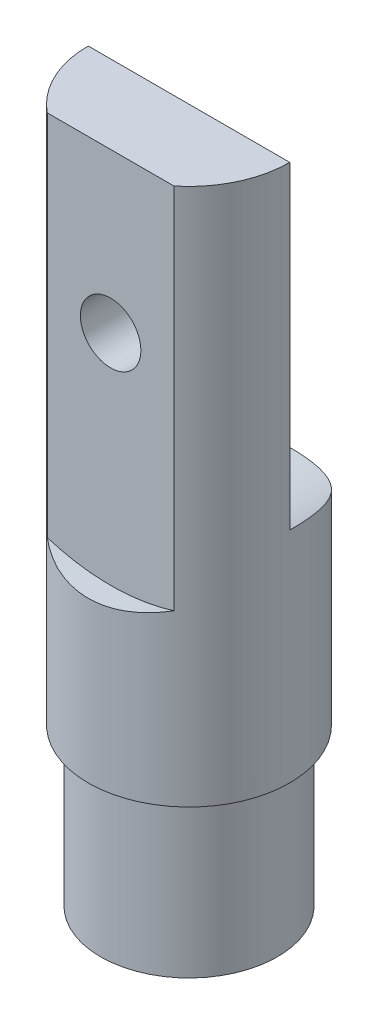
from build123d import *

# Parameters (mm, degrees)
SKETCH1_R           = 4.5
BOSS_EXTRUDE1_DEPTH = 24
SKETCH2_R           = 3.9
BOSS_EXTRUDE2_DEPTH = 7
CUT_EXTRUDE6_START  = -7
SKETCH7_R           = 3.9
CUT_EXTRUDE6_DEPTH  = 7
SKETCH6_R           = 3.95
BOSS_EXTRUDE3_DEPTH = 7
SKETCH15_R          = 2.5
CUT_EXTRUDE18_DEPTH = 9
CUT_EXTRUDE14_START = -8
CUT_EXTRUDE14_DEPTH = 8
SKETCH12_R          = 1.35
CUT_EXTRUDE15_DEPTH = 25.829418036
SKETCH13_R          = 8.42604424
CUT_EXTRUDE16_DEPTH = 8
SKETCH14_R          = 9.45134593
CUT_EXTRUDE17_DEPTH = 8
SKETCH16_W          = 5.634715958
SKETCH16_H          = 5.53714512
SKETCH16_W_2        = 5.059688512
SKETCH16_H_2        = 4
BOSS_EXTRUDE5_DEPTH = 11


with BuildPart() as part:
    # Sketch1 → Boss-Extrude1 (new body)
    with BuildSketch(Plane(origin=(0, 0, 0), x_dir=(1, 0, 0), z_dir=(0, 1, 0))):
        with Locations(Location((0, 0, 0), (0, 0, 270))):
            Circle(SKETCH1_R)
    extrude(amount=BOSS_EXTRUDE1_DEPTH)

    # Sketch2 → Boss-Extrude2 (add)
    with BuildSketch(Plane.XZ):
        with Locations(Location((0, 0, 0), (0, 0, 270))):
            Circle(SKETCH2_R)
    extrude(amount=BOSS_EXTRUDE2_DEPTH)

    # Sketch7 → Cut-Extrude6 (cut)
    with BuildSketch(Plane.XZ.offset(7).offset(CUT_EXTRUDE6_START)):
        Circle(SKETCH7_R)
    extrude(amount=CUT_EXTRUDE6_DEPTH, mode=Mode.SUBTRACT)

    # Sketch6 → Boss-Extrude3 (add)
    with BuildSketch(Plane.XZ.offset(7)):
        with Locations(Location((0, 0, 0), (0, 0, 270))):
            Circle(SKETCH6_R)
    extrude(amount=-BOSS_EXTRUDE3_DEPTH)

    # Sketch15 → Cut-Extrude18 (cut)
    with BuildSketch(Plane.XZ.offset(7)):
        with Locations(Location((0, 0, 0), (0, 0, 270))):
            Circle(SKETCH15_R)
    extrude(amount=-CUT_EXTRUDE18_DEPTH, mode=Mode.SUBTRACT)

    # Sketch11 → Cut-Extrude14 (cut)
    with BuildSketch(Plane(origin=(0, 24, 0), x_dir=(1, 0, 0), z_dir=(0, 1, 0)).offset(CUT_EXTRUDE14_START)):
        with BuildLine():
            Line((-4.5, 0), (4.5, 0))
            ThreePointArc((4.5, 0), (0, 4.5), (-4.5, 0))
        make_face()
        with BuildLine():
            Line((-2.828427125, -3.5), (2.828427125, -3.5))
            ThreePointArc((2.828427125, -3.5), (0, -4.5), (-2.828427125, -3.5))
        make_face()
    extrude(amount=CUT_EXTRUDE14_DEPTH, mode=Mode.SUBTRACT)

    # Sketch12 → Cut-Extrude15 (cut, through all)
    with BuildSketch(Plane(origin=(0, 0, 0), x_dir=(-1, 0, 0), z_dir=(0, 0, -1))):
        with Locations(Location((0, 16.90155662, 0), (0, 0, 318.100988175))):
            Circle(SKETCH12_R)
    extrude(amount=-CUT_EXTRUDE15_DEPTH, mode=Mode.SUBTRACT)

    # Sketch13 → Cut-Extrude16 (cut)
    with BuildSketch(Plane(origin=(0, 0, 0), x_dir=(-1, 0, 0), z_dir=(0, 0, -1))):
        with Locations((0, 16.90155662)):
            Circle(SKETCH13_R)
    extrude(amount=CUT_EXTRUDE16_DEPTH, mode=Mode.SUBTRACT)

    # Sketch14 → Cut-Extrude17 (cut)
    with BuildSketch(Plane.XY.offset(3.5)):
        with Locations((0, 16.591485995)):
            Circle(SKETCH14_R)
    extrude(amount=CUT_EXTRUDE17_DEPTH, mode=Mode.SUBTRACT)

    # Sketch16 → Boss-Extrude5 (add)
    with BuildSketch(Plane.XZ.offset(7)):
        Rectangle(SKETCH16_W, SKETCH16_H)
        Rectangle(SKETCH16_W_2, SKETCH16_H_2, mode=Mode.SUBTRACT)
    extrude(amount=-BOSS_EXTRUDE5_DEPTH)


solid = part.part
